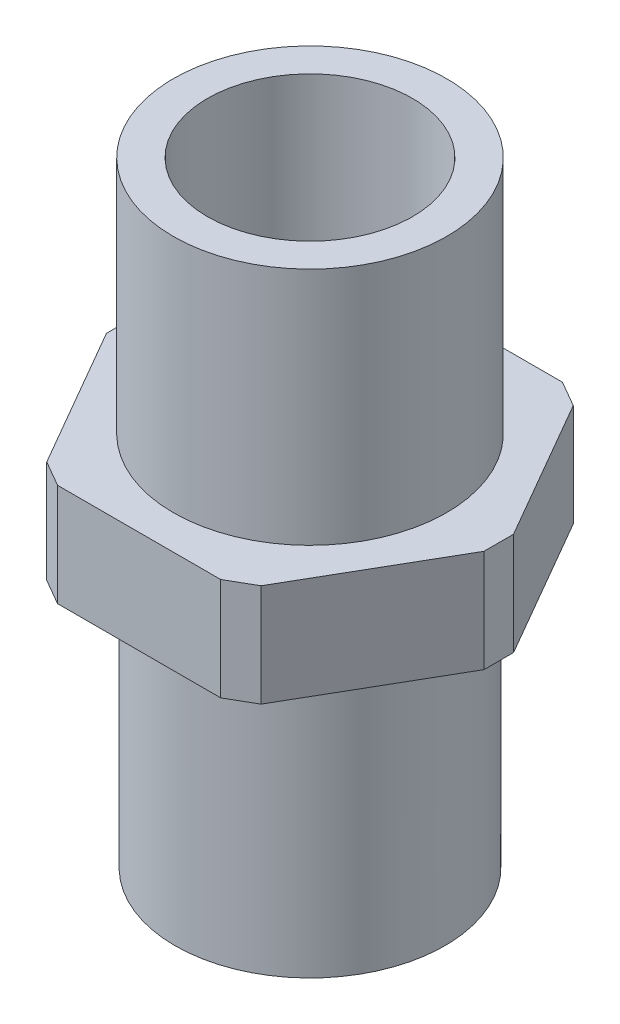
ISO-10303-21;
HEADER;
FILE_DESCRIPTION(('STEP AP214'),'2;1');
FILE_NAME('part.step','',(''),(''),'','','');
FILE_SCHEMA(('AUTOMOTIVE_DESIGN { 1 0 10303 214 1 1 1 1 }'));
ENDSEC;
DATA;
#1=APPLICATION_CONTEXT('core data for automotive mechanical design processes');
#2=APPLICATION_PROTOCOL_DEFINITION('international standard','automotive_design',2000,#1);
#3=PRODUCT_CONTEXT('',#1,'mechanical');
#4=PRODUCT('Part','Part','',(#3));
#5=PRODUCT_RELATED_PRODUCT_CATEGORY('part','',(#4));
#6=PRODUCT_DEFINITION_FORMATION('','',#4);
#7=PRODUCT_DEFINITION_CONTEXT('part definition',#1,'design');
#8=PRODUCT_DEFINITION('design','',#6,#7);
#9=PRODUCT_DEFINITION_SHAPE('','',#8);
#10=(LENGTH_UNIT() NAMED_UNIT(*) SI_UNIT(.MILLI.,.METRE.));
#11=(NAMED_UNIT(*) PLANE_ANGLE_UNIT() SI_UNIT($,.RADIAN.));
#12=(NAMED_UNIT(*) SI_UNIT($,.STERADIAN.) SOLID_ANGLE_UNIT());
#13=UNCERTAINTY_MEASURE_WITH_UNIT(LENGTH_MEASURE(1.E-05),#10,'distance_accuracy_value','');
#14=(GEOMETRIC_REPRESENTATION_CONTEXT(3) GLOBAL_UNCERTAINTY_ASSIGNED_CONTEXT((#13)) GLOBAL_UNIT_ASSIGNED_CONTEXT((#10,
#11,#12)) REPRESENTATION_CONTEXT('',''));
#15=CARTESIAN_POINT('',(0.,0.,0.));
#16=DIRECTION('',(0.,0.,1.));
#17=DIRECTION('',(1.,0.,0.));
#18=AXIS2_PLACEMENT_3D('',#15,#16,#17);
#19=CARTESIAN_POINT('',(5.77350269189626,0.,0.));
#20=DIRECTION('',(0.,1.,0.));
#21=DIRECTION('',(0.,0.,1.));
#22=AXIS2_PLACEMENT_3D('',#19,#20,#21);
#23=PLANE('',#22);
#24=DIRECTION('',(0.5,0.,-0.866025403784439));
#25=VECTOR('',#24,1.);
#26=CARTESIAN_POINT('',(2.88675134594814,0.,5.));
#27=LINE('',#26,#25);
#28=CARTESIAN_POINT('',(3.13675134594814,0.,4.56698729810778));
#29=VERTEX_POINT('',#28);
#30=CARTESIAN_POINT('',(5.52350269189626,0.,0.433012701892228));
#31=VERTEX_POINT('',#30);
#32=EDGE_CURVE('E144',#29,#31,#27,.T.);
#33=ORIENTED_EDGE('',*,*,#32,.F.);
#34=DIRECTION('',(0.866025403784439,0.,-0.5));
#35=VECTOR('',#34,1.);
#36=CARTESIAN_POINT('',(3.13675134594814,0.,4.56698729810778));
#37=LINE('',#36,#35);
#38=CARTESIAN_POINT('',(2.38675134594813,0.,5.));
#39=VERTEX_POINT('',#38);
#40=EDGE_CURVE('E127',#29,#39,#37,.F.);
#41=ORIENTED_EDGE('',*,*,#40,.T.);
#42=DIRECTION('',(1.,0.,0.));
#43=VECTOR('',#42,1.);
#44=CARTESIAN_POINT('',(-2.88675134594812,0.,5.));
#45=LINE('',#44,#43);
#46=CARTESIAN_POINT('',(-2.38675134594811,0.,5.));
#47=VERTEX_POINT('',#46);
#48=EDGE_CURVE('E173',#47,#39,#45,.T.);
#49=ORIENTED_EDGE('',*,*,#48,.F.);
#50=DIRECTION('',(0.866025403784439,0.,0.499999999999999));
#51=VECTOR('',#50,1.);
#52=CARTESIAN_POINT('',(-2.38675134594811,0.,5.));
#53=LINE('',#52,#51);
#54=CARTESIAN_POINT('',(-3.13675134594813,0.,4.56698729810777));
#55=VERTEX_POINT('',#54);
#56=EDGE_CURVE('E183',#47,#55,#53,.F.);
#57=ORIENTED_EDGE('',*,*,#56,.T.);
#58=DIRECTION('',(0.5,0.,0.866025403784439));
#59=VECTOR('',#58,1.);
#60=CARTESIAN_POINT('',(-5.77350269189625,0.,0.));
#61=LINE('',#60,#59);
#62=CARTESIAN_POINT('',(-5.52350269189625,0.,0.433012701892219));
#63=VERTEX_POINT('',#62);
#64=EDGE_CURVE('E171',#63,#55,#61,.T.);
#65=ORIENTED_EDGE('',*,*,#64,.F.);
#66=DIRECTION('',(0.,0.,1.));
#67=VECTOR('',#66,1.);
#68=CARTESIAN_POINT('',(-5.52350269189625,0.,0.433012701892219));
#69=LINE('',#68,#67);
#70=CARTESIAN_POINT('',(-5.52350269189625,0.,-0.43301270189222));
#71=VERTEX_POINT('',#70);
#72=EDGE_CURVE('E148',#63,#71,#69,.F.);
#73=ORIENTED_EDGE('',*,*,#72,.T.);
#74=DIRECTION('',(-0.5,0.,0.866025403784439));
#75=VECTOR('',#74,1.);
#76=CARTESIAN_POINT('',(-2.88675134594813,0.,-5.));
#77=LINE('',#76,#75);
#78=CARTESIAN_POINT('',(-3.13675134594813,0.,-4.56698729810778));
#79=VERTEX_POINT('',#78);
#80=EDGE_CURVE('E168',#79,#71,#77,.T.);
#81=ORIENTED_EDGE('',*,*,#80,.F.);
#82=DIRECTION('',(-0.866025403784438,0.,0.5));
#83=VECTOR('',#82,1.);
#84=CARTESIAN_POINT('',(-3.13675134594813,0.,-4.56698729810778));
#85=LINE('',#84,#83);
#86=CARTESIAN_POINT('',(-2.38675134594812,0.,-5.));
#87=VERTEX_POINT('',#86);
#88=EDGE_CURVE('E185',#79,#87,#85,.F.);
#89=ORIENTED_EDGE('',*,*,#88,.T.);
#90=DIRECTION('',(-1.,0.,0.));
#91=VECTOR('',#90,1.);
#92=CARTESIAN_POINT('',(2.88675134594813,0.,-5.));
#93=LINE('',#92,#91);
#94=CARTESIAN_POINT('',(2.38675134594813,0.,-5.));
#95=VERTEX_POINT('',#94);
#96=EDGE_CURVE('E157',#95,#87,#93,.T.);
#97=ORIENTED_EDGE('',*,*,#96,.F.);
#98=DIRECTION('',(-0.866025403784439,0.,-0.5));
#99=VECTOR('',#98,1.);
#100=CARTESIAN_POINT('',(2.38675134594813,0.,-5.));
#101=LINE('',#100,#99);
#102=CARTESIAN_POINT('',(3.13675134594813,0.,-4.56698729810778));
#103=VERTEX_POINT('',#102);
#104=EDGE_CURVE('E187',#95,#103,#101,.F.);
#105=ORIENTED_EDGE('',*,*,#104,.T.);
#106=DIRECTION('',(-0.5,0.,-0.866025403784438));
#107=VECTOR('',#106,1.);
#108=CARTESIAN_POINT('',(5.77350269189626,0.,0.));
#109=LINE('',#108,#107);
#110=CARTESIAN_POINT('',(5.52350269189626,0.,-0.43301270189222));
#111=VERTEX_POINT('',#110);
#112=EDGE_CURVE('E153',#111,#103,#109,.T.);
#113=ORIENTED_EDGE('',*,*,#112,.F.);
#114=DIRECTION('',(0.,0.,-1.));
#115=VECTOR('',#114,1.);
#116=CARTESIAN_POINT('',(5.52350269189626,0.,-0.43301270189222));
#117=LINE('',#116,#115);
#118=EDGE_CURVE('E138',#111,#31,#117,.F.);
#119=ORIENTED_EDGE('',*,*,#118,.T.);
#120=EDGE_LOOP('',(#33,#41,#49,#57,#65,#73,#81,#89,#97,#105,#113,#119));
#121=FACE_BOUND('',#120,.T.);
#122=CARTESIAN_POINT('',(0.,0.,0.));
#123=DIRECTION('',(0.,1.,0.));
#124=DIRECTION('',(0.,0.,1.));
#125=AXIS2_PLACEMENT_3D('',#122,#123,#124);
#126=CIRCLE('',#125,3.95);
#127=CARTESIAN_POINT('',(0.,0.,3.95));
#128=VERTEX_POINT('',#127);
#129=EDGE_CURVE('E178',#128,#128,#126,.F.);
#130=ORIENTED_EDGE('',*,*,#129,.F.);
#131=EDGE_LOOP('',(#130));
#132=FACE_BOUND('',#131,.T.);
#133=ADVANCED_FACE('F38',(#121,#132),#23,.F.);
#134=CARTESIAN_POINT('',(5.77350269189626,3.,0.));
#135=DIRECTION('',(0.,1.,0.));
#136=DIRECTION('',(0.,0.,1.));
#137=AXIS2_PLACEMENT_3D('',#134,#135,#136);
#138=PLANE('',#137);
#139=DIRECTION('',(1.,0.,0.));
#140=VECTOR('',#139,1.);
#141=CARTESIAN_POINT('',(-2.88675134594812,3.,5.));
#142=LINE('',#141,#140);
#143=CARTESIAN_POINT('',(-2.38675134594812,3.,5.));
#144=VERTEX_POINT('',#143);
#145=CARTESIAN_POINT('',(2.38675134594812,3.,5.));
#146=VERTEX_POINT('',#145);
#147=EDGE_CURVE('E163',#144,#146,#142,.T.);
#148=ORIENTED_EDGE('',*,*,#147,.T.);
#149=DIRECTION('',(-0.866025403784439,0.,0.5));
#150=VECTOR('',#149,1.);
#151=CARTESIAN_POINT('',(7.09187836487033,3.,2.28349364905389));
#152=LINE('',#151,#150);
#153=CARTESIAN_POINT('',(3.13675134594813,3.,4.56698729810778));
#154=VERTEX_POINT('',#153);
#155=EDGE_CURVE('E202',#146,#154,#152,.F.);
#156=ORIENTED_EDGE('',*,*,#155,.T.);
#157=DIRECTION('',(0.5,0.,-0.866025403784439));
#158=VECTOR('',#157,1.);
#159=CARTESIAN_POINT('',(2.88675134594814,3.,5.));
#160=LINE('',#159,#158);
#161=CARTESIAN_POINT('',(5.52350269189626,3.,0.433012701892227));
#162=VERTEX_POINT('',#161);
#163=EDGE_CURVE('E147',#154,#162,#160,.T.);
#164=ORIENTED_EDGE('',*,*,#163,.T.);
#165=DIRECTION('',(0.,0.,1.));
#166=VECTOR('',#165,1.);
#167=CARTESIAN_POINT('',(5.52350269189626,3.,0.));
#168=LINE('',#167,#166);
#169=CARTESIAN_POINT('',(5.52350269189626,3.,-0.43301270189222));
#170=VERTEX_POINT('',#169);
#171=EDGE_CURVE('E200',#162,#170,#168,.F.);
#172=ORIENTED_EDGE('',*,*,#171,.T.);
#173=DIRECTION('',(-0.5,0.,-0.866025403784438));
#174=VECTOR('',#173,1.);
#175=CARTESIAN_POINT('',(5.77350269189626,3.,0.));
#176=LINE('',#175,#174);
#177=CARTESIAN_POINT('',(3.13675134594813,3.,-4.56698729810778));
#178=VERTEX_POINT('',#177);
#179=EDGE_CURVE('E239',#170,#178,#176,.T.);
#180=ORIENTED_EDGE('',*,*,#179,.T.);
#181=DIRECTION('',(0.866025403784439,0.,0.5));
#182=VECTOR('',#181,1.);
#183=CARTESIAN_POINT('',(7.09187836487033,3.,-2.28349364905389));
#184=LINE('',#183,#182);
#185=CARTESIAN_POINT('',(2.38675134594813,3.,-5.));
#186=VERTEX_POINT('',#185);
#187=EDGE_CURVE('E198',#178,#186,#184,.F.);
#188=ORIENTED_EDGE('',*,*,#187,.T.);
#189=DIRECTION('',(-1.,0.,0.));
#190=VECTOR('',#189,1.);
#191=CARTESIAN_POINT('',(2.88675134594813,3.,-5.));
#192=LINE('',#191,#190);
#193=CARTESIAN_POINT('',(-2.38675134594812,3.,-5.));
#194=VERTEX_POINT('',#193);
#195=EDGE_CURVE('E234',#186,#194,#192,.T.);
#196=ORIENTED_EDGE('',*,*,#195,.T.);
#197=DIRECTION('',(0.866025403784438,0.,-0.5));
#198=VECTOR('',#197,1.);
#199=CARTESIAN_POINT('',(1.56837567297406,3.,-7.28349364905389));
#200=LINE('',#199,#198);
#201=CARTESIAN_POINT('',(-3.13675134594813,3.,-4.56698729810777));
#202=VERTEX_POINT('',#201);
#203=EDGE_CURVE('E196',#194,#202,#200,.F.);
#204=ORIENTED_EDGE('',*,*,#203,.T.);
#205=DIRECTION('',(-0.5,0.,0.866025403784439));
#206=VECTOR('',#205,1.);
#207=CARTESIAN_POINT('',(-2.88675134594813,3.,-5.));
#208=LINE('',#207,#206);
#209=CARTESIAN_POINT('',(-5.52350269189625,3.,-0.43301270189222));
#210=VERTEX_POINT('',#209);
#211=EDGE_CURVE('E233',#202,#210,#208,.T.);
#212=ORIENTED_EDGE('',*,*,#211,.T.);
#213=DIRECTION('',(0.,0.,-1.));
#214=VECTOR('',#213,1.);
#215=CARTESIAN_POINT('',(-5.52350269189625,3.,0.));
#216=LINE('',#215,#214);
#217=CARTESIAN_POINT('',(-5.52350269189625,3.,0.433012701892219));
#218=VERTEX_POINT('',#217);
#219=EDGE_CURVE('E58',#210,#218,#216,.F.);
#220=ORIENTED_EDGE('',*,*,#219,.T.);
#221=DIRECTION('',(0.5,0.,0.866025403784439));
#222=VECTOR('',#221,1.);
#223=CARTESIAN_POINT('',(-5.77350269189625,3.,0.));
#224=LINE('',#223,#222);
#225=CARTESIAN_POINT('',(-3.13675134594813,3.,4.56698729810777));
#226=VERTEX_POINT('',#225);
#227=EDGE_CURVE('E222',#218,#226,#224,.T.);
#228=ORIENTED_EDGE('',*,*,#227,.T.);
#229=DIRECTION('',(-0.866025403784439,0.,-0.499999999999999));
#230=VECTOR('',#229,1.);
#231=CARTESIAN_POINT('',(1.56837567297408,3.,7.28349364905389));
#232=LINE('',#231,#230);
#233=EDGE_CURVE('E194',#226,#144,#232,.F.);
#234=ORIENTED_EDGE('',*,*,#233,.T.);
#235=EDGE_LOOP('',(#148,#156,#164,#172,#180,#188,#196,#204,#212,#220,#228,#234));
#236=FACE_BOUND('',#235,.T.);
#237=CARTESIAN_POINT('',(0.,3.,0.));
#238=DIRECTION('',(0.,1.,0.));
#239=DIRECTION('',(0.,0.,1.));
#240=AXIS2_PLACEMENT_3D('',#237,#238,#239);
#241=CIRCLE('',#240,4.);
#242=CARTESIAN_POINT('',(0.,3.,4.));
#243=VERTEX_POINT('',#242);
#244=EDGE_CURVE('E160',#243,#243,#241,.T.);
#245=ORIENTED_EDGE('',*,*,#244,.F.);
#246=EDGE_LOOP('',(#245));
#247=FACE_BOUND('',#246,.T.);
#248=ADVANCED_FACE('F261',(#236,#247),#138,.T.);
#249=CARTESIAN_POINT('',(2.88675134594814,3.,5.));
#250=DIRECTION('',(-0.866025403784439,0.,-0.5));
#251=DIRECTION('',(-0.5,0.,0.866025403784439));
#252=AXIS2_PLACEMENT_3D('',#249,#250,#251);
#253=PLANE('',#252);
#254=ORIENTED_EDGE('',*,*,#163,.F.);
#255=DIRECTION('',(0.,-1.,0.));
#256=VECTOR('',#255,1.);
#257=CARTESIAN_POINT('',(3.13675134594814,3.,4.56698729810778));
#258=LINE('',#257,#256);
#259=EDGE_CURVE('E131',#154,#29,#258,.T.);
#260=ORIENTED_EDGE('',*,*,#259,.T.);
#261=ORIENTED_EDGE('',*,*,#32,.T.);
#262=DIRECTION('',(0.,1.,0.));
#263=VECTOR('',#262,1.);
#264=CARTESIAN_POINT('',(5.52350269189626,3.,0.433012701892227));
#265=LINE('',#264,#263);
#266=EDGE_CURVE('E149',#31,#162,#265,.T.);
#267=ORIENTED_EDGE('',*,*,#266,.T.);
#268=EDGE_LOOP('',(#254,#260,#261,#267));
#269=FACE_BOUND('',#268,.T.);
#270=ADVANCED_FACE('F143',(#269),#253,.F.);
#271=CARTESIAN_POINT('',(5.77350269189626,3.,0.));
#272=DIRECTION('',(-0.866025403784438,0.,0.500000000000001));
#273=DIRECTION('',(0.500000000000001,0.,0.866025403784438));
#274=AXIS2_PLACEMENT_3D('',#271,#272,#273);
#275=PLANE('',#274);
#276=ORIENTED_EDGE('',*,*,#179,.F.);
#277=DIRECTION('',(0.,-1.,0.));
#278=VECTOR('',#277,1.);
#279=CARTESIAN_POINT('',(5.52350269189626,3.,-0.43301270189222));
#280=LINE('',#279,#278);
#281=EDGE_CURVE('E206',#170,#111,#280,.T.);
#282=ORIENTED_EDGE('',*,*,#281,.T.);
#283=ORIENTED_EDGE('',*,*,#112,.T.);
#284=DIRECTION('',(0.,1.,0.));
#285=VECTOR('',#284,1.);
#286=CARTESIAN_POINT('',(3.13675134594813,3.,-4.56698729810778));
#287=LINE('',#286,#285);
#288=EDGE_CURVE('E204',#103,#178,#287,.T.);
#289=ORIENTED_EDGE('',*,*,#288,.T.);
#290=EDGE_LOOP('',(#276,#282,#283,#289));
#291=FACE_BOUND('',#290,.T.);
#292=ADVANCED_FACE('F281',(#291),#275,.F.);
#293=CARTESIAN_POINT('',(2.88675134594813,3.,-5.));
#294=DIRECTION('',(0.,0.,1.));
#295=DIRECTION('',(1.,0.,0.));
#296=AXIS2_PLACEMENT_3D('',#293,#294,#295);
#297=PLANE('',#296);
#298=ORIENTED_EDGE('',*,*,#195,.F.);
#299=DIRECTION('',(0.,-1.,0.));
#300=VECTOR('',#299,1.);
#301=CARTESIAN_POINT('',(2.38675134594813,3.,-5.));
#302=LINE('',#301,#300);
#303=EDGE_CURVE('E211',#186,#95,#302,.T.);
#304=ORIENTED_EDGE('',*,*,#303,.T.);
#305=ORIENTED_EDGE('',*,*,#96,.T.);
#306=DIRECTION('',(0.,1.,0.));
#307=VECTOR('',#306,1.);
#308=CARTESIAN_POINT('',(-2.38675134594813,3.,-5.));
#309=LINE('',#308,#307);
#310=EDGE_CURVE('E209',#87,#194,#309,.T.);
#311=ORIENTED_EDGE('',*,*,#310,.T.);
#312=EDGE_LOOP('',(#298,#304,#305,#311));
#313=FACE_BOUND('',#312,.T.);
#314=ADVANCED_FACE('F277',(#313),#297,.F.);
#315=CARTESIAN_POINT('',(-2.88675134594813,3.,-5.));
#316=DIRECTION('',(0.866025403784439,0.,0.5));
#317=DIRECTION('',(0.5,0.,-0.866025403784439));
#318=AXIS2_PLACEMENT_3D('',#315,#316,#317);
#319=PLANE('',#318);
#320=ORIENTED_EDGE('',*,*,#211,.F.);
#321=DIRECTION('',(0.,-1.,0.));
#322=VECTOR('',#321,1.);
#323=CARTESIAN_POINT('',(-3.13675134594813,3.,-4.56698729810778));
#324=LINE('',#323,#322);
#325=EDGE_CURVE('E216',#202,#79,#324,.T.);
#326=ORIENTED_EDGE('',*,*,#325,.T.);
#327=ORIENTED_EDGE('',*,*,#80,.T.);
#328=DIRECTION('',(0.,1.,0.));
#329=VECTOR('',#328,1.);
#330=CARTESIAN_POINT('',(-5.52350269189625,3.,-0.43301270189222));
#331=LINE('',#330,#329);
#332=EDGE_CURVE('E214',#71,#210,#331,.T.);
#333=ORIENTED_EDGE('',*,*,#332,.T.);
#334=EDGE_LOOP('',(#320,#326,#327,#333));
#335=FACE_BOUND('',#334,.T.);
#336=ADVANCED_FACE('F274',(#335),#319,.F.);
#337=CARTESIAN_POINT('',(-5.77350269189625,3.,0.));
#338=DIRECTION('',(0.866025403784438,0.,-0.5));
#339=DIRECTION('',(-0.5,0.,-0.866025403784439));
#340=AXIS2_PLACEMENT_3D('',#337,#338,#339);
#341=PLANE('',#340);
#342=ORIENTED_EDGE('',*,*,#64,.T.);
#343=DIRECTION('',(0.,1.,0.));
#344=VECTOR('',#343,1.);
#345=CARTESIAN_POINT('',(-3.13675134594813,3.,4.56698729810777));
#346=LINE('',#345,#344);
#347=EDGE_CURVE('E11',#55,#226,#346,.T.);
#348=ORIENTED_EDGE('',*,*,#347,.T.);
#349=ORIENTED_EDGE('',*,*,#227,.F.);
#350=DIRECTION('',(0.,-1.,0.));
#351=VECTOR('',#350,1.);
#352=CARTESIAN_POINT('',(-5.52350269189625,3.,0.433012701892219));
#353=LINE('',#352,#351);
#354=EDGE_CURVE('E46',#218,#63,#353,.T.);
#355=ORIENTED_EDGE('',*,*,#354,.T.);
#356=EDGE_LOOP('',(#342,#348,#349,#355));
#357=FACE_BOUND('',#356,.T.);
#358=ADVANCED_FACE('F221',(#357),#341,.F.);
#359=CARTESIAN_POINT('',(-2.88675134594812,3.,5.));
#360=DIRECTION('',(0.,0.,-1.));
#361=DIRECTION('',(-1.,0.,0.));
#362=AXIS2_PLACEMENT_3D('',#359,#360,#361);
#363=PLANE('',#362);
#364=ORIENTED_EDGE('',*,*,#48,.T.);
#365=DIRECTION('',(0.,1.,0.));
#366=VECTOR('',#365,1.);
#367=CARTESIAN_POINT('',(2.38675134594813,3.,5.));
#368=LINE('',#367,#366);
#369=EDGE_CURVE('E132',#39,#146,#368,.T.);
#370=ORIENTED_EDGE('',*,*,#369,.T.);
#371=ORIENTED_EDGE('',*,*,#147,.F.);
#372=DIRECTION('',(0.,-1.,0.));
#373=VECTOR('',#372,1.);
#374=CARTESIAN_POINT('',(-2.38675134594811,3.,5.));
#375=LINE('',#374,#373);
#376=EDGE_CURVE('E137',#144,#47,#375,.T.);
#377=ORIENTED_EDGE('',*,*,#376,.T.);
#378=EDGE_LOOP('',(#364,#370,#371,#377));
#379=FACE_BOUND('',#378,.T.);
#380=ADVANCED_FACE('F231',(#379),#363,.F.);
#381=CARTESIAN_POINT('',(0.,10.,0.));
#382=DIRECTION('',(0.,1.,0.));
#383=DIRECTION('',(0.,0.,1.));
#384=AXIS2_PLACEMENT_3D('',#381,#382,#383);
#385=PLANE('',#384);
#386=CARTESIAN_POINT('',(0.,10.,0.));
#387=DIRECTION('',(0.,1.,0.));
#388=DIRECTION('',(0.,0.,1.));
#389=AXIS2_PLACEMENT_3D('',#386,#387,#388);
#390=CIRCLE('',#389,4.);
#391=CARTESIAN_POINT('',(0.,10.,4.));
#392=VERTEX_POINT('',#391);
#393=EDGE_CURVE('E154',#392,#392,#390,.T.);
#394=ORIENTED_EDGE('',*,*,#393,.T.);
#395=EDGE_LOOP('',(#394));
#396=FACE_BOUND('',#395,.T.);
#397=CARTESIAN_POINT('',(0.,10.,0.));
#398=DIRECTION('',(0.,1.,0.));
#399=DIRECTION('',(0.,0.,1.));
#400=AXIS2_PLACEMENT_3D('',#397,#398,#399);
#401=CIRCLE('',#400,3.);
#402=CARTESIAN_POINT('',(0.,10.,3.));
#403=VERTEX_POINT('',#402);
#404=EDGE_CURVE('E244',#403,#403,#401,.T.);
#405=ORIENTED_EDGE('',*,*,#404,.F.);
#406=EDGE_LOOP('',(#405));
#407=FACE_BOUND('',#406,.T.);
#408=ADVANCED_FACE('F271',(#396,#407),#385,.T.);
#409=CARTESIAN_POINT('',(0.,10.,0.));
#410=DIRECTION('',(0.,-1.,0.));
#411=DIRECTION('',(0.,0.,-1.));
#412=AXIS2_PLACEMENT_3D('',#409,#410,#411);
#413=CYLINDRICAL_SURFACE('',#412,4.);
#414=ORIENTED_EDGE('',*,*,#393,.F.);
#415=EDGE_LOOP('',(#414));
#416=FACE_BOUND('',#415,.T.);
#417=ORIENTED_EDGE('',*,*,#244,.T.);
#418=EDGE_LOOP('',(#417));
#419=FACE_BOUND('',#418,.T.);
#420=ADVANCED_FACE('F323',(#416,#419),#413,.T.);
#421=CARTESIAN_POINT('',(0.,10.,0.));
#422=DIRECTION('',(0.,-1.,0.));
#423=DIRECTION('',(0.,0.,-1.));
#424=AXIS2_PLACEMENT_3D('',#421,#422,#423);
#425=CYLINDRICAL_SURFACE('',#424,3.);
#426=ORIENTED_EDGE('',*,*,#404,.T.);
#427=EDGE_LOOP('',(#426));
#428=FACE_BOUND('',#427,.T.);
#429=CARTESIAN_POINT('',(0.,3.,0.));
#430=DIRECTION('',(0.,1.,0.));
#431=DIRECTION('',(0.,0.,1.));
#432=AXIS2_PLACEMENT_3D('',#429,#430,#431);
#433=CIRCLE('',#432,3.);
#434=CARTESIAN_POINT('',(0.,3.,3.));
#435=VERTEX_POINT('',#434);
#436=EDGE_CURVE('E175',#435,#435,#433,.F.);
#437=ORIENTED_EDGE('',*,*,#436,.T.);
#438=EDGE_LOOP('',(#437));
#439=FACE_BOUND('',#438,.T.);
#440=ADVANCED_FACE('F325',(#428,#439),#425,.F.);
#441=ORIENTED_EDGE('',*,*,#436,.F.);
#442=EDGE_LOOP('',(#441));
#443=FACE_BOUND('',#442,.T.);
#444=ADVANCED_FACE('F257',(#443),#138,.T.);
#445=CARTESIAN_POINT('',(0.,-8.,0.));
#446=DIRECTION('',(0.,1.,0.));
#447=DIRECTION('',(0.,0.,1.));
#448=AXIS2_PLACEMENT_3D('',#445,#446,#447);
#449=CYLINDRICAL_SURFACE('',#448,3.95);
#450=CARTESIAN_POINT('',(0.,-8.,0.));
#451=DIRECTION('',(0.,-1.,0.));
#452=DIRECTION('',(0.,0.,-1.));
#453=AXIS2_PLACEMENT_3D('',#450,#451,#452);
#454=CIRCLE('',#453,3.95);
#455=CARTESIAN_POINT('',(0.,-8.,-3.95));
#456=VERTEX_POINT('',#455);
#457=EDGE_CURVE('E248',#456,#456,#454,.T.);
#458=ORIENTED_EDGE('',*,*,#457,.F.);
#459=EDGE_LOOP('',(#458));
#460=FACE_BOUND('',#459,.T.);
#461=ORIENTED_EDGE('',*,*,#129,.T.);
#462=EDGE_LOOP('',(#461));
#463=FACE_BOUND('',#462,.T.);
#464=ADVANCED_FACE('F254',(#460,#463),#449,.T.);
#465=CARTESIAN_POINT('',(0.,-8.,0.));
#466=DIRECTION('',(0.,-1.,0.));
#467=DIRECTION('',(0.,0.,-1.));
#468=AXIS2_PLACEMENT_3D('',#465,#466,#467);
#469=PLANE('',#468);
#470=ORIENTED_EDGE('',*,*,#457,.T.);
#471=EDGE_LOOP('',(#470));
#472=FACE_BOUND('',#471,.T.);
#473=ADVANCED_FACE('F252',(#472),#469,.T.);
#474=CARTESIAN_POINT('',(3.13675134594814,3.,4.56698729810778));
#475=DIRECTION('',(-0.5,0.,-0.866025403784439));
#476=DIRECTION('',(-0.866025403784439,0.,0.5));
#477=AXIS2_PLACEMENT_3D('',#474,#475,#476);
#478=PLANE('',#477);
#479=ORIENTED_EDGE('',*,*,#155,.F.);
#480=ORIENTED_EDGE('',*,*,#369,.F.);
#481=ORIENTED_EDGE('',*,*,#40,.F.);
#482=ORIENTED_EDGE('',*,*,#259,.F.);
#483=EDGE_LOOP('',(#479,#480,#481,#482));
#484=FACE_BOUND('',#483,.T.);
#485=ADVANCED_FACE('F130',(#484),#478,.F.);
#486=CARTESIAN_POINT('',(5.52350269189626,3.,-0.43301270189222));
#487=DIRECTION('',(-1.,0.,0.));
#488=DIRECTION('',(0.,0.,1.));
#489=AXIS2_PLACEMENT_3D('',#486,#487,#488);
#490=PLANE('',#489);
#491=ORIENTED_EDGE('',*,*,#171,.F.);
#492=ORIENTED_EDGE('',*,*,#266,.F.);
#493=ORIENTED_EDGE('',*,*,#118,.F.);
#494=ORIENTED_EDGE('',*,*,#281,.F.);
#495=EDGE_LOOP('',(#491,#492,#493,#494));
#496=FACE_BOUND('',#495,.T.);
#497=ADVANCED_FACE('F290',(#496),#490,.F.);
#498=CARTESIAN_POINT('',(2.38675134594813,3.,-5.));
#499=DIRECTION('',(-0.5,0.,0.866025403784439));
#500=DIRECTION('',(0.866025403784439,0.,0.5));
#501=AXIS2_PLACEMENT_3D('',#498,#499,#500);
#502=PLANE('',#501);
#503=ORIENTED_EDGE('',*,*,#187,.F.);
#504=ORIENTED_EDGE('',*,*,#288,.F.);
#505=ORIENTED_EDGE('',*,*,#104,.F.);
#506=ORIENTED_EDGE('',*,*,#303,.F.);
#507=EDGE_LOOP('',(#503,#504,#505,#506));
#508=FACE_BOUND('',#507,.T.);
#509=ADVANCED_FACE('F293',(#508),#502,.F.);
#510=CARTESIAN_POINT('',(-3.13675134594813,3.,-4.56698729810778));
#511=DIRECTION('',(0.5,0.,0.866025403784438));
#512=DIRECTION('',(0.866025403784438,0.,-0.5));
#513=AXIS2_PLACEMENT_3D('',#510,#511,#512);
#514=PLANE('',#513);
#515=ORIENTED_EDGE('',*,*,#203,.F.);
#516=ORIENTED_EDGE('',*,*,#310,.F.);
#517=ORIENTED_EDGE('',*,*,#88,.F.);
#518=ORIENTED_EDGE('',*,*,#325,.F.);
#519=EDGE_LOOP('',(#515,#516,#517,#518));
#520=FACE_BOUND('',#519,.T.);
#521=ADVANCED_FACE('F297',(#520),#514,.F.);
#522=CARTESIAN_POINT('',(-2.38675134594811,3.,5.));
#523=DIRECTION('',(0.499999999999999,0.,-0.866025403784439));
#524=DIRECTION('',(-0.866025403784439,0.,-0.499999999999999));
#525=AXIS2_PLACEMENT_3D('',#522,#523,#524);
#526=PLANE('',#525);
#527=ORIENTED_EDGE('',*,*,#233,.F.);
#528=ORIENTED_EDGE('',*,*,#347,.F.);
#529=ORIENTED_EDGE('',*,*,#56,.F.);
#530=ORIENTED_EDGE('',*,*,#376,.F.);
#531=EDGE_LOOP('',(#527,#528,#529,#530));
#532=FACE_BOUND('',#531,.T.);
#533=ADVANCED_FACE('F228',(#532),#526,.F.);
#534=CARTESIAN_POINT('',(-5.52350269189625,3.,0.433012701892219));
#535=DIRECTION('',(1.,0.,0.));
#536=DIRECTION('',(0.,0.,-1.));
#537=AXIS2_PLACEMENT_3D('',#534,#535,#536);
#538=PLANE('',#537);
#539=ORIENTED_EDGE('',*,*,#219,.F.);
#540=ORIENTED_EDGE('',*,*,#332,.F.);
#541=ORIENTED_EDGE('',*,*,#72,.F.);
#542=ORIENTED_EDGE('',*,*,#354,.F.);
#543=EDGE_LOOP('',(#539,#540,#541,#542));
#544=FACE_BOUND('',#543,.T.);
#545=ADVANCED_FACE('F40',(#544),#538,.F.);
#546=CLOSED_SHELL('',(#133,#248,#270,#292,#314,#336,#358,#380,#408,#420,#440,#444,#464,#473,
#485,#497,#509,#521,#533,#545));
#547=MANIFOLD_SOLID_BREP('B2',#546);
#548=ADVANCED_BREP_SHAPE_REPRESENTATION('',(#18,#547),#14);
#549=SHAPE_DEFINITION_REPRESENTATION(#9,#548);
ENDSEC;
END-ISO-10303-21;
